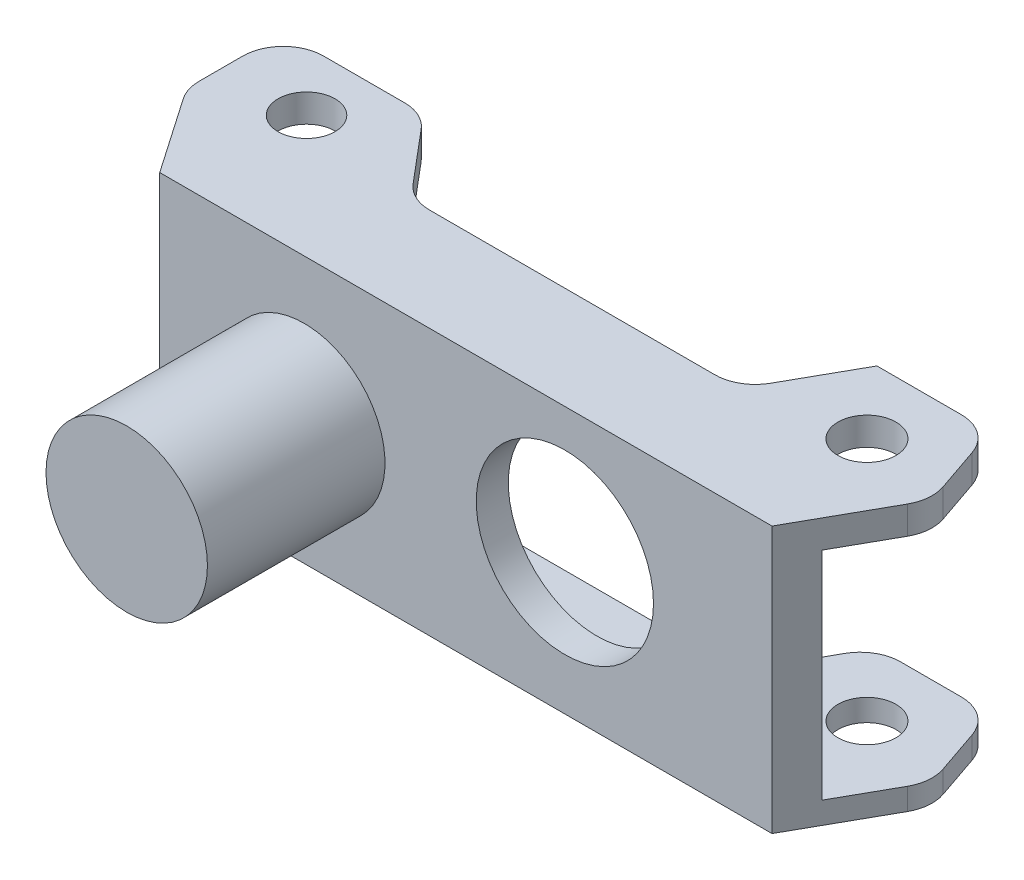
ISO-10303-21;
HEADER;
FILE_DESCRIPTION(('STEP AP214'),'2;1');
FILE_NAME('part.step','',(''),(''),'','','');
FILE_SCHEMA(('AUTOMOTIVE_DESIGN { 1 0 10303 214 1 1 1 1 }'));
ENDSEC;
DATA;
#1=APPLICATION_CONTEXT('core data for automotive mechanical design processes');
#2=APPLICATION_PROTOCOL_DEFINITION('international standard','automotive_design',2000,#1);
#3=PRODUCT_CONTEXT('',#1,'mechanical');
#4=PRODUCT('Part','Part','',(#3));
#5=PRODUCT_RELATED_PRODUCT_CATEGORY('part','',(#4));
#6=PRODUCT_DEFINITION_FORMATION('','',#4);
#7=PRODUCT_DEFINITION_CONTEXT('part definition',#1,'design');
#8=PRODUCT_DEFINITION('design','',#6,#7);
#9=PRODUCT_DEFINITION_SHAPE('','',#8);
#10=(LENGTH_UNIT() NAMED_UNIT(*) SI_UNIT(.MILLI.,.METRE.));
#11=(NAMED_UNIT(*) PLANE_ANGLE_UNIT() SI_UNIT($,.RADIAN.));
#12=(NAMED_UNIT(*) SI_UNIT($,.STERADIAN.) SOLID_ANGLE_UNIT());
#13=UNCERTAINTY_MEASURE_WITH_UNIT(LENGTH_MEASURE(1.E-05),#10,'distance_accuracy_value','');
#14=(GEOMETRIC_REPRESENTATION_CONTEXT(3) GLOBAL_UNCERTAINTY_ASSIGNED_CONTEXT((#13)) GLOBAL_UNIT_ASSIGNED_CONTEXT((#10,
#11,#12)) REPRESENTATION_CONTEXT('',''));
#15=CARTESIAN_POINT('',(0.,0.,0.));
#16=DIRECTION('',(0.,0.,1.));
#17=DIRECTION('',(1.,0.,0.));
#18=AXIS2_PLACEMENT_3D('',#15,#16,#17);
#19=CARTESIAN_POINT('',(-23.2643645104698,-33.,-17.6761686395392));
#20=DIRECTION('',(-1.,0.,0.));
#21=DIRECTION('',(0.,0.,1.));
#22=AXIS2_PLACEMENT_3D('',#19,#20,#21);
#23=PLANE('',#22);
#24=DIRECTION('',(0.,0.,-1.));
#25=VECTOR('',#24,1.);
#26=CARTESIAN_POINT('',(-23.2643645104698,-3.45993507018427,-32.8437082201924));
#27=LINE('',#26,#25);
#28=CARTESIAN_POINT('',(-23.2643645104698,-3.45993507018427,-19.2320013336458));
#29=VERTEX_POINT('',#28);
#30=CARTESIAN_POINT('',(-23.2643645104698,-3.45993507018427,-24.6517278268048));
#31=VERTEX_POINT('',#30);
#32=EDGE_CURVE('E287',#29,#31,#27,.T.);
#33=ORIENTED_EDGE('',*,*,#32,.F.);
#34=DIRECTION('',(0.,1.,0.));
#35=VECTOR('',#34,1.);
#36=CARTESIAN_POINT('',(-23.2643645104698,-33.,-19.2320013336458));
#37=LINE('',#36,#35);
#38=CARTESIAN_POINT('',(-23.2643645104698,0.,-19.2320013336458));
#39=VERTEX_POINT('',#38);
#40=EDGE_CURVE('E512',#29,#39,#37,.T.);
#41=ORIENTED_EDGE('',*,*,#40,.T.);
#42=DIRECTION('',(0.,0.,1.));
#43=VECTOR('',#42,1.);
#44=CARTESIAN_POINT('',(-23.2643645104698,0.,-17.6761686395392));
#45=LINE('',#44,#43);
#46=CARTESIAN_POINT('',(-23.2643645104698,0.,-24.6517278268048));
#47=VERTEX_POINT('',#46);
#48=EDGE_CURVE('E366',#47,#39,#45,.T.);
#49=ORIENTED_EDGE('',*,*,#48,.F.);
#50=DIRECTION('',(0.,1.,0.));
#51=VECTOR('',#50,1.);
#52=CARTESIAN_POINT('',(-23.2643645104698,-33.,-24.6517278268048));
#53=LINE('',#52,#51);
#54=EDGE_CURVE('E510',#47,#31,#53,.F.);
#55=ORIENTED_EDGE('',*,*,#54,.T.);
#56=EDGE_LOOP('',(#33,#41,#49,#55));
#57=FACE_BOUND('',#56,.T.);
#58=ADVANCED_FACE('F36',(#57),#23,.T.);
#59=CARTESIAN_POINT('',(-23.2643645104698,-33.,-29.6517278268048));
#60=DIRECTION('',(0.,0.,-1.));
#61=DIRECTION('',(-1.,0.,0.));
#62=AXIS2_PLACEMENT_3D('',#59,#60,#61);
#63=PLANE('',#62);
#64=DIRECTION('',(-1.,0.,0.));
#65=VECTOR('',#64,1.);
#66=CARTESIAN_POINT('',(-23.2643645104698,0.,-29.6517278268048));
#67=LINE('',#66,#65);
#68=CARTESIAN_POINT('',(-8.20956267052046,0.,-29.6517278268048));
#69=VERTEX_POINT('',#68);
#70=CARTESIAN_POINT('',(-18.2643645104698,0.,-29.6517278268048));
#71=VERTEX_POINT('',#70);
#72=EDGE_CURVE('E363',#69,#71,#67,.T.);
#73=ORIENTED_EDGE('',*,*,#72,.F.);
#74=DIRECTION('',(0.,1.,0.));
#75=VECTOR('',#74,1.);
#76=CARTESIAN_POINT('',(-8.20956267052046,-33.,-29.6517278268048));
#77=LINE('',#76,#75);
#78=CARTESIAN_POINT('',(-8.20956267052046,-3.45993507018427,-29.6517278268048));
#79=VERTEX_POINT('',#78);
#80=EDGE_CURVE('E494',#69,#79,#77,.F.);
#81=ORIENTED_EDGE('',*,*,#80,.T.);
#82=DIRECTION('',(1.,0.,0.));
#83=VECTOR('',#82,1.);
#84=CARTESIAN_POINT('',(-23.2643645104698,-3.45993507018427,-29.6517278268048));
#85=LINE('',#84,#83);
#86=CARTESIAN_POINT('',(-18.2643645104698,-3.45993507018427,-29.6517278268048));
#87=VERTEX_POINT('',#86);
#88=EDGE_CURVE('E308',#87,#79,#85,.T.);
#89=ORIENTED_EDGE('',*,*,#88,.F.);
#90=DIRECTION('',(0.,1.,0.));
#91=VECTOR('',#90,1.);
#92=CARTESIAN_POINT('',(-18.2643645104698,-33.,-29.6517278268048));
#93=LINE('',#92,#91);
#94=EDGE_CURVE('E491',#87,#71,#93,.T.);
#95=ORIENTED_EDGE('',*,*,#94,.T.);
#96=EDGE_LOOP('',(#73,#81,#89,#95));
#97=FACE_BOUND('',#96,.T.);
#98=ADVANCED_FACE('F697',(#97),#63,.T.);
#99=CARTESIAN_POINT('',(-5.88455509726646,-33.,-29.6517278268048));
#100=DIRECTION('',(0.764662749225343,0.,-0.644430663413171));
#101=DIRECTION('',(-0.644430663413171,0.,-0.764662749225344));
#102=AXIS2_PLACEMENT_3D('',#99,#100,#101);
#103=PLANE('',#102);
#104=DIRECTION('',(-0.644430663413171,0.,-0.764662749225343));
#105=VECTOR('',#104,1.);
#106=CARTESIAN_POINT('',(-5.88455509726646,0.,-29.6517278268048));
#107=LINE('',#106,#105);
#108=CARTESIAN_POINT('',(1.01174835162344,0.,-21.4687740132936));
#109=VERTEX_POINT('',#108);
#110=CARTESIAN_POINT('',(-4.38624892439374,0.,-27.8738811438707));
#111=VERTEX_POINT('',#110);
#112=EDGE_CURVE('E360',#109,#111,#107,.T.);
#113=ORIENTED_EDGE('',*,*,#112,.F.);
#114=DIRECTION('',(0.,1.,0.));
#115=VECTOR('',#114,1.);
#116=CARTESIAN_POINT('',(1.01174835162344,-3.45993507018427,-21.4687740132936));
#117=LINE('',#116,#115);
#118=CARTESIAN_POINT('',(1.01174835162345,-3.45993507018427,-21.4687740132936));
#119=VERTEX_POINT('',#118);
#120=EDGE_CURVE('E489',#109,#119,#117,.F.);
#121=ORIENTED_EDGE('',*,*,#120,.T.);
#122=DIRECTION('',(0.644430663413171,0.,0.764662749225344));
#123=VECTOR('',#122,1.);
#124=CARTESIAN_POINT('',(-5.88455509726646,-3.45993507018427,-29.6517278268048));
#125=LINE('',#124,#123);
#126=CARTESIAN_POINT('',(-4.38624892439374,-3.45993507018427,-27.8738811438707));
#127=VERTEX_POINT('',#126);
#128=EDGE_CURVE('E305',#127,#119,#125,.T.);
#129=ORIENTED_EDGE('',*,*,#128,.F.);
#130=DIRECTION('',(0.,1.,0.));
#131=VECTOR('',#130,1.);
#132=CARTESIAN_POINT('',(-4.38624892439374,-33.,-27.8738811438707));
#133=LINE('',#132,#131);
#134=EDGE_CURVE('E486',#127,#111,#133,.T.);
#135=ORIENTED_EDGE('',*,*,#134,.T.);
#136=EDGE_LOOP('',(#113,#121,#129,#135));
#137=FACE_BOUND('',#136,.T.);
#138=ADVANCED_FACE('F534',(#137),#103,.T.);
#139=CARTESIAN_POINT('',(2.51005452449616,-33.,-19.6909273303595));
#140=DIRECTION('',(0.,0.,-1.));
#141=DIRECTION('',(-1.,0.,0.));
#142=AXIS2_PLACEMENT_3D('',#139,#140,#141);
#143=PLANE('',#142);
#144=DIRECTION('',(-1.,0.,0.));
#145=VECTOR('',#144,1.);
#146=CARTESIAN_POINT('',(2.51005452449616,0.,-19.6909273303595));
#147=LINE('',#146,#145);
#148=CARTESIAN_POINT('',(40.1852218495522,0.,-19.6909273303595));
#149=VERTEX_POINT('',#148);
#150=CARTESIAN_POINT('',(4.83506209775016,0.,-19.6909273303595));
#151=VERTEX_POINT('',#150);
#152=EDGE_CURVE('E357',#149,#151,#147,.T.);
#153=ORIENTED_EDGE('',*,*,#152,.F.);
#154=DIRECTION('',(0.,1.,0.));
#155=VECTOR('',#154,1.);
#156=CARTESIAN_POINT('',(40.1852218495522,-3.45993507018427,-19.6909273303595));
#157=LINE('',#156,#155);
#158=CARTESIAN_POINT('',(40.1852218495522,-3.45993507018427,-19.6909273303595));
#159=VERTEX_POINT('',#158);
#160=EDGE_CURVE('E479',#149,#159,#157,.F.);
#161=ORIENTED_EDGE('',*,*,#160,.T.);
#162=DIRECTION('',(1.,0.,0.));
#163=VECTOR('',#162,1.);
#164=CARTESIAN_POINT('',(2.51005452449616,-3.45993507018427,-19.6909273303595));
#165=LINE('',#164,#163);
#166=CARTESIAN_POINT('',(4.83506209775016,-3.45993507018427,-19.6909273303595));
#167=VERTEX_POINT('',#166);
#168=EDGE_CURVE('E303',#167,#159,#165,.T.);
#169=ORIENTED_EDGE('',*,*,#168,.F.);
#170=DIRECTION('',(0.,1.,0.));
#171=VECTOR('',#170,1.);
#172=CARTESIAN_POINT('',(4.83506209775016,0.,-19.6909273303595));
#173=LINE('',#172,#171);
#174=EDGE_CURVE('E476',#167,#151,#173,.T.);
#175=ORIENTED_EDGE('',*,*,#174,.T.);
#176=EDGE_LOOP('',(#153,#161,#169,#175));
#177=FACE_BOUND('',#176,.T.);
#178=ADVANCED_FACE('F542',(#177),#143,.T.);
#179=CARTESIAN_POINT('',(43.114449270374,-33.,-19.6909273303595));
#180=DIRECTION('',(-0.872303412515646,0.,-0.488964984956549));
#181=DIRECTION('',(-0.488964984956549,0.,0.872303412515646));
#182=AXIS2_PLACEMENT_3D('',#179,#180,#181);
#183=PLANE('',#182);
#184=DIRECTION('',(0.488964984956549,0.,-0.872303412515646));
#185=VECTOR('',#184,1.);
#186=CARTESIAN_POINT('',(43.114449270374,-3.45993507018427,-19.6909273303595));
#187=LINE('',#186,#185);
#188=CARTESIAN_POINT('',(44.5467389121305,-3.45993507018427,-22.2461024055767));
#189=VERTEX_POINT('',#188);
#190=CARTESIAN_POINT('',(49.2733082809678,-3.45993507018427,-30.6782043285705));
#191=VERTEX_POINT('',#190);
#192=EDGE_CURVE('E301',#189,#191,#187,.T.);
#193=ORIENTED_EDGE('',*,*,#192,.F.);
#194=DIRECTION('',(0.,1.,0.));
#195=VECTOR('',#194,1.);
#196=CARTESIAN_POINT('',(44.5467389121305,0.,-22.2461024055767));
#197=LINE('',#196,#195);
#198=CARTESIAN_POINT('',(44.5467389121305,0.,-22.2461024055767));
#199=VERTEX_POINT('',#198);
#200=EDGE_CURVE('E473',#189,#199,#197,.T.);
#201=ORIENTED_EDGE('',*,*,#200,.T.);
#202=DIRECTION('',(-0.488964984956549,0.,0.872303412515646));
#203=VECTOR('',#202,1.);
#204=CARTESIAN_POINT('',(43.114449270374,0.,-19.6909273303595));
#205=LINE('',#204,#203);
#206=CARTESIAN_POINT('',(49.2733082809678,0.,-30.6782043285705));
#207=VERTEX_POINT('',#206);
#208=EDGE_CURVE('E354',#207,#199,#205,.T.);
#209=ORIENTED_EDGE('',*,*,#208,.F.);
#210=DIRECTION('',(0.,1.,0.));
#211=VECTOR('',#210,1.);
#212=CARTESIAN_POINT('',(49.2733082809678,-33.,-30.6782043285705));
#213=LINE('',#212,#211);
#214=EDGE_CURVE('E374',#191,#207,#213,.T.);
#215=ORIENTED_EDGE('',*,*,#214,.F.);
#216=EDGE_LOOP('',(#193,#201,#209,#215));
#217=FACE_BOUND('',#216,.T.);
#218=ADVANCED_FACE('F549',(#217),#183,.T.);
#219=CARTESIAN_POINT('',(49.2733082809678,-33.,-30.6782043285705));
#220=DIRECTION('',(0.,0.,-1.));
#221=DIRECTION('',(-1.,0.,0.));
#222=AXIS2_PLACEMENT_3D('',#219,#220,#221);
#223=PLANE('',#222);
#224=DIRECTION('',(-1.,0.,0.));
#225=VECTOR('',#224,1.);
#226=CARTESIAN_POINT('',(49.2733082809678,0.,-30.6782043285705));
#227=LINE('',#226,#225);
#228=CARTESIAN_POINT('',(59.7293711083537,0.,-30.6782043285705));
#229=VERTEX_POINT('',#228);
#230=EDGE_CURVE('E352',#229,#207,#227,.T.);
#231=ORIENTED_EDGE('',*,*,#230,.F.);
#232=DIRECTION('',(0.,1.,0.));
#233=VECTOR('',#232,1.);
#234=CARTESIAN_POINT('',(59.7293711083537,-33.,-30.6782043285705));
#235=LINE('',#234,#233);
#236=CARTESIAN_POINT('',(59.7293711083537,-3.45993507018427,-30.6782043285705));
#237=VERTEX_POINT('',#236);
#238=EDGE_CURVE('E52',#229,#237,#235,.F.);
#239=ORIENTED_EDGE('',*,*,#238,.T.);
#240=DIRECTION('',(1.,0.,0.));
#241=VECTOR('',#240,1.);
#242=CARTESIAN_POINT('',(49.2733082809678,-3.45993507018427,-30.6782043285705));
#243=LINE('',#242,#241);
#244=EDGE_CURVE('E296',#191,#237,#243,.T.);
#245=ORIENTED_EDGE('',*,*,#244,.F.);
#246=ORIENTED_EDGE('',*,*,#214,.T.);
#247=EDGE_LOOP('',(#231,#239,#245,#246));
#248=FACE_BOUND('',#247,.T.);
#249=ADVANCED_FACE('F551',(#248),#223,.T.);
#250=CARTESIAN_POINT('',(63.3018204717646,-33.,-30.6782043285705));
#251=DIRECTION('',(0.946033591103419,0.,-0.324068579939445));
#252=DIRECTION('',(-0.324068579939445,0.,-0.946033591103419));
#253=AXIS2_PLACEMENT_3D('',#250,#251,#252);
#254=PLANE('',#253);
#255=DIRECTION('',(-0.324068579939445,0.,-0.946033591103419));
#256=VECTOR('',#255,1.);
#257=CARTESIAN_POINT('',(63.3018204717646,0.,-30.6782043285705));
#258=LINE('',#257,#256);
#259=CARTESIAN_POINT('',(66.341063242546,0.,-21.8059287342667));
#260=VERTEX_POINT('',#259);
#261=CARTESIAN_POINT('',(64.4595390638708,0.,-27.2985472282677));
#262=VERTEX_POINT('',#261);
#263=EDGE_CURVE('E349',#260,#262,#258,.T.);
#264=ORIENTED_EDGE('',*,*,#263,.F.);
#265=DIRECTION('',(0.,1.,0.));
#266=VECTOR('',#265,1.);
#267=CARTESIAN_POINT('',(66.341063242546,-33.,-21.8059287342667));
#268=LINE('',#267,#266);
#269=CARTESIAN_POINT('',(66.341063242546,-3.45993507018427,-21.8059287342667));
#270=VERTEX_POINT('',#269);
#271=EDGE_CURVE('E445',#260,#270,#268,.F.);
#272=ORIENTED_EDGE('',*,*,#271,.T.);
#273=DIRECTION('',(0.324068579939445,0.,0.946033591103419));
#274=VECTOR('',#273,1.);
#275=CARTESIAN_POINT('',(63.3018204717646,-3.45993507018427,-30.6782043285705));
#276=LINE('',#275,#274);
#277=CARTESIAN_POINT('',(64.4595390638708,-3.45993507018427,-27.2985472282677));
#278=VERTEX_POINT('',#277);
#279=EDGE_CURVE('E293',#278,#270,#276,.T.);
#280=ORIENTED_EDGE('',*,*,#279,.F.);
#281=DIRECTION('',(0.,1.,0.));
#282=VECTOR('',#281,1.);
#283=CARTESIAN_POINT('',(64.4595390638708,-33.,-27.2985472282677));
#284=LINE('',#283,#282);
#285=EDGE_CURVE('E442',#278,#262,#284,.T.);
#286=ORIENTED_EDGE('',*,*,#285,.T.);
#287=EDGE_LOOP('',(#264,#272,#280,#286));
#288=FACE_BOUND('',#287,.T.);
#289=ADVANCED_FACE('F559',(#288),#254,.T.);
#290=CARTESIAN_POINT('',(2.,-17.2270584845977,15.));
#291=DIRECTION('',(0.,0.,-1.));
#292=DIRECTION('',(-1.,0.,0.));
#293=AXIS2_PLACEMENT_3D('',#290,#291,#292);
#294=CYLINDRICAL_SURFACE('',#293,10.);
#295=CARTESIAN_POINT('',(2.,-17.2270584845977,15.));
#296=DIRECTION('',(0.,0.,1.));
#297=DIRECTION('',(1.,0.,0.));
#298=AXIS2_PLACEMENT_3D('',#295,#296,#297);
#299=CIRCLE('',#298,10.);
#300=CARTESIAN_POINT('',(12.,-17.2270584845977,15.));
#301=VERTEX_POINT('',#300);
#302=EDGE_CURVE('E380',#301,#301,#299,.T.);
#303=ORIENTED_EDGE('',*,*,#302,.F.);
#304=EDGE_LOOP('',(#303));
#305=FACE_BOUND('',#304,.T.);
#306=CARTESIAN_POINT('',(2.,-17.2270584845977,-7.));
#307=DIRECTION('',(0.,0.,-1.));
#308=DIRECTION('',(-1.,0.,0.));
#309=AXIS2_PLACEMENT_3D('',#306,#307,#308);
#310=CIRCLE('',#309,10.);
#311=CARTESIAN_POINT('',(-8.,-17.2270584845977,-7.));
#312=VERTEX_POINT('',#311);
#313=EDGE_CURVE('E373',#312,#312,#310,.T.);
#314=ORIENTED_EDGE('',*,*,#313,.F.);
#315=EDGE_LOOP('',(#314));
#316=FACE_BOUND('',#315,.T.);
#317=ADVANCED_FACE('F836',(#305,#316),#294,.T.);
#318=CARTESIAN_POINT('',(2.,-17.2270584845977,15.));
#319=DIRECTION('',(0.,0.,1.));
#320=DIRECTION('',(1.,0.,0.));
#321=AXIS2_PLACEMENT_3D('',#318,#319,#320);
#322=PLANE('',#321);
#323=ORIENTED_EDGE('',*,*,#302,.T.);
#324=EDGE_LOOP('',(#323));
#325=FACE_BOUND('',#324,.T.);
#326=ADVANCED_FACE('F715',(#325),#322,.T.);
#327=CARTESIAN_POINT('',(59.9517366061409,-33.,-7.));
#328=DIRECTION('',(0.,0.,1.));
#329=DIRECTION('',(1.,0.,0.));
#330=AXIS2_PLACEMENT_3D('',#327,#328,#329);
#331=PLANE('',#330);
#332=CARTESIAN_POINT('',(34.2854004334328,-15.6525262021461,-7.));
#333=DIRECTION('',(0.,0.,1.));
#334=DIRECTION('',(1.,0.,0.));
#335=AXIS2_PLACEMENT_3D('',#332,#333,#334);
#336=CIRCLE('',#335,10.9809764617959);
#337=CARTESIAN_POINT('',(45.2663768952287,-15.6525262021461,-7.));
#338=VERTEX_POINT('',#337);
#339=EDGE_CURVE('E679',#338,#338,#336,.T.);
#340=ORIENTED_EDGE('',*,*,#339,.F.);
#341=EDGE_LOOP('',(#340));
#342=FACE_BOUND('',#341,.T.);
#343=DIRECTION('',(1.,0.,0.));
#344=VECTOR('',#343,1.);
#345=CARTESIAN_POINT('',(59.9517366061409,0.,-7.));
#346=LINE('',#345,#344);
#347=CARTESIAN_POINT('',(-15.9079495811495,0.,-7.));
#348=VERTEX_POINT('',#347);
#349=CARTESIAN_POINT('',(59.9517366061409,0.,-7.));
#350=VERTEX_POINT('',#349);
#351=EDGE_CURVE('E312',#348,#350,#346,.T.);
#352=ORIENTED_EDGE('',*,*,#351,.F.);
#353=DIRECTION('',(0.,1.,0.));
#354=VECTOR('',#353,1.);
#355=CARTESIAN_POINT('',(-15.9079495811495,-33.,-7.));
#356=LINE('',#355,#354);
#357=CARTESIAN_POINT('',(-15.9079495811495,-33.,-7.));
#358=VERTEX_POINT('',#357);
#359=EDGE_CURVE('E370',#358,#348,#356,.T.);
#360=ORIENTED_EDGE('',*,*,#359,.F.);
#361=DIRECTION('',(1.,0.,0.));
#362=VECTOR('',#361,1.);
#363=CARTESIAN_POINT('',(59.9517366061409,-33.,-7.));
#364=LINE('',#363,#362);
#365=CARTESIAN_POINT('',(59.9517366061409,-33.,-7.));
#366=VERTEX_POINT('',#365);
#367=EDGE_CURVE('E313',#358,#366,#364,.T.);
#368=ORIENTED_EDGE('',*,*,#367,.T.);
#369=DIRECTION('',(0.,1.,0.));
#370=VECTOR('',#369,1.);
#371=CARTESIAN_POINT('',(59.9517366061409,-33.,-7.));
#372=LINE('',#371,#370);
#373=EDGE_CURVE('E343',#366,#350,#372,.T.);
#374=ORIENTED_EDGE('',*,*,#373,.T.);
#375=EDGE_LOOP('',(#352,#360,#368,#374));
#376=FACE_BOUND('',#375,.T.);
#377=ORIENTED_EDGE('',*,*,#313,.T.);
#378=EDGE_LOOP('',(#377));
#379=FACE_BOUND('',#378,.T.);
#380=ADVANCED_FACE('F650',(#342,#376,#379),#331,.T.);
#381=CARTESIAN_POINT('',(-15.9079495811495,-33.,-7.));
#382=DIRECTION('',(-0.823445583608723,0.,0.567395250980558));
#383=DIRECTION('',(0.567395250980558,0.,0.823445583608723));
#384=AXIS2_PLACEMENT_3D('',#381,#382,#383);
#385=PLANE('',#384);
#386=DIRECTION('',(0.567395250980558,0.,0.823445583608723));
#387=VECTOR('',#386,1.);
#388=CARTESIAN_POINT('',(-15.9079495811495,-30.2846895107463,-7.));
#389=LINE('',#388,#387);
#390=CARTESIAN_POINT('',(-22.3815924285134,-30.2846895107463,-16.395025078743));
#391=VERTEX_POINT('',#390);
#392=CARTESIAN_POINT('',(-18.6453012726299,-30.2846895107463,-10.9726454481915));
#393=VERTEX_POINT('',#392);
#394=EDGE_CURVE('E265',#391,#393,#389,.T.);
#395=ORIENTED_EDGE('',*,*,#394,.F.);
#396=DIRECTION('',(0.,1.,0.));
#397=VECTOR('',#396,1.);
#398=CARTESIAN_POINT('',(-22.3815924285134,-33.,-16.395025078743));
#399=LINE('',#398,#397);
#400=CARTESIAN_POINT('',(-22.3815924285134,-33.,-16.395025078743));
#401=VERTEX_POINT('',#400);
#402=EDGE_CURVE('E508',#391,#401,#399,.F.);
#403=ORIENTED_EDGE('',*,*,#402,.T.);
#404=DIRECTION('',(0.567395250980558,0.,0.823445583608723));
#405=VECTOR('',#404,1.);
#406=CARTESIAN_POINT('',(-15.9079495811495,-33.,-7.));
#407=LINE('',#406,#405);
#408=EDGE_CURVE('E341',#401,#358,#407,.T.);
#409=ORIENTED_EDGE('',*,*,#408,.T.);
#410=ORIENTED_EDGE('',*,*,#359,.T.);
#411=DIRECTION('',(0.567395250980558,0.,0.823445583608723));
#412=VECTOR('',#411,1.);
#413=CARTESIAN_POINT('',(-15.9079495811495,0.,-7.));
#414=LINE('',#413,#412);
#415=CARTESIAN_POINT('',(-22.3815924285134,0.,-16.395025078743));
#416=VERTEX_POINT('',#415);
#417=EDGE_CURVE('E317',#416,#348,#414,.T.);
#418=ORIENTED_EDGE('',*,*,#417,.F.);
#419=DIRECTION('',(0.,1.,0.));
#420=VECTOR('',#419,1.);
#421=CARTESIAN_POINT('',(-22.3815924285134,-33.,-16.395025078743));
#422=LINE('',#421,#420);
#423=CARTESIAN_POINT('',(-22.3815924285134,-3.45993507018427,-16.395025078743));
#424=VERTEX_POINT('',#423);
#425=EDGE_CURVE('E506',#416,#424,#422,.F.);
#426=ORIENTED_EDGE('',*,*,#425,.T.);
#427=DIRECTION('',(-0.567395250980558,0.,-0.823445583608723));
#428=VECTOR('',#427,1.);
#429=CARTESIAN_POINT('',(-15.9079495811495,-3.45993507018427,-7.));
#430=LINE('',#429,#428);
#431=CARTESIAN_POINT('',(-18.6453012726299,-3.45993507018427,-10.9726454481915));
#432=VERTEX_POINT('',#431);
#433=EDGE_CURVE('E292',#432,#424,#430,.T.);
#434=ORIENTED_EDGE('',*,*,#433,.F.);
#435=DIRECTION('',(0.,1.,0.));
#436=VECTOR('',#435,1.);
#437=CARTESIAN_POINT('',(-18.6453012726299,-33.,-10.9726454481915));
#438=LINE('',#437,#436);
#439=EDGE_CURVE('E276',#393,#432,#438,.T.);
#440=ORIENTED_EDGE('',*,*,#439,.F.);
#441=EDGE_LOOP('',(#395,#403,#409,#410,#418,#426,#434,#440));
#442=FACE_BOUND('',#441,.T.);
#443=ADVANCED_FACE('F290',(#442),#385,.T.);
#444=DIRECTION('',(0.,0.,1.));
#445=VECTOR('',#444,1.);
#446=CARTESIAN_POINT('',(-23.2643645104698,-33.,-17.6761686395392));
#447=LINE('',#446,#445);
#448=CARTESIAN_POINT('',(-23.2643645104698,-33.,-24.6517278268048));
#449=VERTEX_POINT('',#448);
#450=CARTESIAN_POINT('',(-23.2643645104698,-33.,-19.2320013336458));
#451=VERTEX_POINT('',#450);
#452=EDGE_CURVE('E338',#449,#451,#447,.T.);
#453=ORIENTED_EDGE('',*,*,#452,.T.);
#454=DIRECTION('',(0.,1.,0.));
#455=VECTOR('',#454,1.);
#456=CARTESIAN_POINT('',(-23.2643645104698,-33.,-19.2320013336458));
#457=LINE('',#456,#455);
#458=CARTESIAN_POINT('',(-23.2643645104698,-30.2846895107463,-19.2320013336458));
#459=VERTEX_POINT('',#458);
#460=EDGE_CURVE('E503',#451,#459,#457,.T.);
#461=ORIENTED_EDGE('',*,*,#460,.T.);
#462=DIRECTION('',(0.,0.,1.));
#463=VECTOR('',#462,1.);
#464=CARTESIAN_POINT('',(-23.2643645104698,-30.2846895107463,-32.8437082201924));
#465=LINE('',#464,#463);
#466=CARTESIAN_POINT('',(-23.2643645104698,-30.2846895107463,-24.6517278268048));
#467=VERTEX_POINT('',#466);
#468=EDGE_CURVE('E661',#467,#459,#465,.T.);
#469=ORIENTED_EDGE('',*,*,#468,.F.);
#470=DIRECTION('',(0.,1.,0.));
#471=VECTOR('',#470,1.);
#472=CARTESIAN_POINT('',(-23.2643645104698,-33.,-24.6517278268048));
#473=LINE('',#472,#471);
#474=EDGE_CURVE('E501',#467,#449,#473,.F.);
#475=ORIENTED_EDGE('',*,*,#474,.T.);
#476=EDGE_LOOP('',(#453,#461,#469,#475));
#477=FACE_BOUND('',#476,.T.);
#478=ADVANCED_FACE('F660',(#477),#23,.T.);
#479=DIRECTION('',(-1.,0.,0.));
#480=VECTOR('',#479,1.);
#481=CARTESIAN_POINT('',(-23.2643645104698,-30.2846895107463,-29.6517278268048));
#482=LINE('',#481,#480);
#483=CARTESIAN_POINT('',(-8.20956267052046,-30.2846895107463,-29.6517278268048));
#484=VERTEX_POINT('',#483);
#485=CARTESIAN_POINT('',(-18.2643645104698,-30.2846895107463,-29.6517278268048));
#486=VERTEX_POINT('',#485);
#487=EDGE_CURVE('E277',#484,#486,#482,.T.);
#488=ORIENTED_EDGE('',*,*,#487,.F.);
#489=DIRECTION('',(0.,1.,0.));
#490=VECTOR('',#489,1.);
#491=CARTESIAN_POINT('',(-8.20956267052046,-33.,-29.6517278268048));
#492=LINE('',#491,#490);
#493=CARTESIAN_POINT('',(-8.20956267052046,-33.,-29.6517278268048));
#494=VERTEX_POINT('',#493);
#495=EDGE_CURVE('E499',#484,#494,#492,.F.);
#496=ORIENTED_EDGE('',*,*,#495,.T.);
#497=DIRECTION('',(-1.,0.,0.));
#498=VECTOR('',#497,1.);
#499=CARTESIAN_POINT('',(-23.2643645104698,-33.,-29.6517278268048));
#500=LINE('',#499,#498);
#501=CARTESIAN_POINT('',(-18.2643645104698,-33.,-29.6517278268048));
#502=VERTEX_POINT('',#501);
#503=EDGE_CURVE('E335',#494,#502,#500,.T.);
#504=ORIENTED_EDGE('',*,*,#503,.T.);
#505=DIRECTION('',(0.,1.,0.));
#506=VECTOR('',#505,1.);
#507=CARTESIAN_POINT('',(-18.2643645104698,-33.,-29.6517278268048));
#508=LINE('',#507,#506);
#509=EDGE_CURVE('E496',#502,#486,#508,.T.);
#510=ORIENTED_EDGE('',*,*,#509,.T.);
#511=EDGE_LOOP('',(#488,#496,#504,#510));
#512=FACE_BOUND('',#511,.T.);
#513=ADVANCED_FACE('F592',(#512),#63,.T.);
#514=DIRECTION('',(-0.644430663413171,0.,-0.764662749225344));
#515=VECTOR('',#514,1.);
#516=CARTESIAN_POINT('',(-5.88455509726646,-30.2846895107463,-29.6517278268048));
#517=LINE('',#516,#515);
#518=CARTESIAN_POINT('',(1.01174835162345,-30.2846895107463,-21.4687740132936));
#519=VERTEX_POINT('',#518);
#520=CARTESIAN_POINT('',(-4.38624892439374,-30.2846895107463,-27.8738811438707));
#521=VERTEX_POINT('',#520);
#522=EDGE_CURVE('E585',#519,#521,#517,.T.);
#523=ORIENTED_EDGE('',*,*,#522,.F.);
#524=DIRECTION('',(0.,1.,0.));
#525=VECTOR('',#524,1.);
#526=CARTESIAN_POINT('',(1.01174835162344,-33.,-21.4687740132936));
#527=LINE('',#526,#525);
#528=CARTESIAN_POINT('',(1.01174835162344,-33.,-21.4687740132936));
#529=VERTEX_POINT('',#528);
#530=EDGE_CURVE('E484',#519,#529,#527,.F.);
#531=ORIENTED_EDGE('',*,*,#530,.T.);
#532=DIRECTION('',(-0.644430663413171,0.,-0.764662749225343));
#533=VECTOR('',#532,1.);
#534=CARTESIAN_POINT('',(-5.88455509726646,-33.,-29.6517278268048));
#535=LINE('',#534,#533);
#536=CARTESIAN_POINT('',(-4.38624892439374,-33.,-27.8738811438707));
#537=VERTEX_POINT('',#536);
#538=EDGE_CURVE('E332',#529,#537,#535,.T.);
#539=ORIENTED_EDGE('',*,*,#538,.T.);
#540=DIRECTION('',(0.,1.,0.));
#541=VECTOR('',#540,1.);
#542=CARTESIAN_POINT('',(-4.38624892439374,-33.,-27.8738811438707));
#543=LINE('',#542,#541);
#544=EDGE_CURVE('E481',#537,#521,#543,.T.);
#545=ORIENTED_EDGE('',*,*,#544,.T.);
#546=EDGE_LOOP('',(#523,#531,#539,#545));
#547=FACE_BOUND('',#546,.T.);
#548=ADVANCED_FACE('F606',(#547),#103,.T.);
#549=DIRECTION('',(-1.,0.,0.));
#550=VECTOR('',#549,1.);
#551=CARTESIAN_POINT('',(2.51005452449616,-30.2846895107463,-19.6909273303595));
#552=LINE('',#551,#550);
#553=CARTESIAN_POINT('',(40.1852218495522,-30.2846895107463,-19.6909273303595));
#554=VERTEX_POINT('',#553);
#555=CARTESIAN_POINT('',(4.83506209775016,-30.2846895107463,-19.6909273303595));
#556=VERTEX_POINT('',#555);
#557=EDGE_CURVE('E582',#554,#556,#552,.T.);
#558=ORIENTED_EDGE('',*,*,#557,.F.);
#559=DIRECTION('',(0.,1.,0.));
#560=VECTOR('',#559,1.);
#561=CARTESIAN_POINT('',(40.1852218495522,-33.,-19.6909273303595));
#562=LINE('',#561,#560);
#563=CARTESIAN_POINT('',(40.1852218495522,-33.,-19.6909273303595));
#564=VERTEX_POINT('',#563);
#565=EDGE_CURVE('E471',#554,#564,#562,.F.);
#566=ORIENTED_EDGE('',*,*,#565,.T.);
#567=DIRECTION('',(-1.,0.,0.));
#568=VECTOR('',#567,1.);
#569=CARTESIAN_POINT('',(2.51005452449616,-33.,-19.6909273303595));
#570=LINE('',#569,#568);
#571=CARTESIAN_POINT('',(4.83506209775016,-33.,-19.6909273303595));
#572=VERTEX_POINT('',#571);
#573=EDGE_CURVE('E329',#564,#572,#570,.T.);
#574=ORIENTED_EDGE('',*,*,#573,.T.);
#575=DIRECTION('',(0.,1.,0.));
#576=VECTOR('',#575,1.);
#577=CARTESIAN_POINT('',(4.83506209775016,-30.2846895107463,-19.6909273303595));
#578=LINE('',#577,#576);
#579=EDGE_CURVE('E468',#572,#556,#578,.T.);
#580=ORIENTED_EDGE('',*,*,#579,.T.);
#581=EDGE_LOOP('',(#558,#566,#574,#580));
#582=FACE_BOUND('',#581,.T.);
#583=ADVANCED_FACE('F615',(#582),#143,.T.);
#584=DIRECTION('',(-0.488964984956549,0.,0.872303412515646));
#585=VECTOR('',#584,1.);
#586=CARTESIAN_POINT('',(43.114449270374,-30.2846895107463,-19.6909273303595));
#587=LINE('',#586,#585);
#588=CARTESIAN_POINT('',(47.8410186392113,-30.2846895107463,-28.1230292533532));
#589=VERTEX_POINT('',#588);
#590=CARTESIAN_POINT('',(44.5467389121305,-30.2846895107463,-22.2461024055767));
#591=VERTEX_POINT('',#590);
#592=EDGE_CURVE('E579',#589,#591,#587,.T.);
#593=ORIENTED_EDGE('',*,*,#592,.F.);
#594=DIRECTION('',(0.,1.,0.));
#595=VECTOR('',#594,1.);
#596=CARTESIAN_POINT('',(47.8410186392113,-33.,-28.1230292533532));
#597=LINE('',#596,#595);
#598=CARTESIAN_POINT('',(47.8410186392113,-33.,-28.1230292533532));
#599=VERTEX_POINT('',#598);
#600=EDGE_CURVE('E466',#589,#599,#597,.F.);
#601=ORIENTED_EDGE('',*,*,#600,.T.);
#602=DIRECTION('',(-0.488964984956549,0.,0.872303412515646));
#603=VECTOR('',#602,1.);
#604=CARTESIAN_POINT('',(43.114449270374,-33.,-19.6909273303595));
#605=LINE('',#604,#603);
#606=CARTESIAN_POINT('',(44.5467389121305,-33.,-22.2461024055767));
#607=VERTEX_POINT('',#606);
#608=EDGE_CURVE('E326',#599,#607,#605,.T.);
#609=ORIENTED_EDGE('',*,*,#608,.T.);
#610=DIRECTION('',(0.,1.,0.));
#611=VECTOR('',#610,1.);
#612=CARTESIAN_POINT('',(44.5467389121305,-30.2846895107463,-22.2461024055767));
#613=LINE('',#612,#611);
#614=EDGE_CURVE('E463',#607,#591,#613,.T.);
#615=ORIENTED_EDGE('',*,*,#614,.T.);
#616=EDGE_LOOP('',(#593,#601,#609,#615));
#617=FACE_BOUND('',#616,.T.);
#618=ADVANCED_FACE('F624',(#617),#183,.T.);
#619=DIRECTION('',(-1.,0.,0.));
#620=VECTOR('',#619,1.);
#621=CARTESIAN_POINT('',(49.2733082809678,-30.2846895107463,-30.6782043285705));
#622=LINE('',#621,#620);
#623=CARTESIAN_POINT('',(59.7293711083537,-30.2846895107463,-30.6782043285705));
#624=VERTEX_POINT('',#623);
#625=CARTESIAN_POINT('',(52.2025357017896,-30.2846895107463,-30.6782043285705));
#626=VERTEX_POINT('',#625);
#627=EDGE_CURVE('E572',#624,#626,#622,.T.);
#628=ORIENTED_EDGE('',*,*,#627,.F.);
#629=DIRECTION('',(0.,1.,0.));
#630=VECTOR('',#629,1.);
#631=CARTESIAN_POINT('',(59.7293711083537,-33.,-30.6782043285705));
#632=LINE('',#631,#630);
#633=CARTESIAN_POINT('',(59.7293711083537,-33.,-30.6782043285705));
#634=VERTEX_POINT('',#633);
#635=EDGE_CURVE('E461',#624,#634,#632,.F.);
#636=ORIENTED_EDGE('',*,*,#635,.T.);
#637=DIRECTION('',(-1.,0.,0.));
#638=VECTOR('',#637,1.);
#639=CARTESIAN_POINT('',(49.2733082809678,-33.,-30.6782043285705));
#640=LINE('',#639,#638);
#641=CARTESIAN_POINT('',(52.2025357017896,-33.,-30.6782043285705));
#642=VERTEX_POINT('',#641);
#643=EDGE_CURVE('E323',#634,#642,#640,.T.);
#644=ORIENTED_EDGE('',*,*,#643,.T.);
#645=DIRECTION('',(0.,1.,0.));
#646=VECTOR('',#645,1.);
#647=CARTESIAN_POINT('',(52.2025357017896,-33.,-30.6782043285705));
#648=LINE('',#647,#646);
#649=EDGE_CURVE('E458',#642,#626,#648,.T.);
#650=ORIENTED_EDGE('',*,*,#649,.T.);
#651=EDGE_LOOP('',(#628,#636,#644,#650));
#652=FACE_BOUND('',#651,.T.);
#653=ADVANCED_FACE('F633',(#652),#223,.T.);
#654=DIRECTION('',(-0.324068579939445,0.,-0.946033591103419));
#655=VECTOR('',#654,1.);
#656=CARTESIAN_POINT('',(63.3018204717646,-30.2846895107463,-30.6782043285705));
#657=LINE('',#656,#655);
#658=CARTESIAN_POINT('',(66.341063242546,-30.2846895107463,-21.8059287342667));
#659=VERTEX_POINT('',#658);
#660=CARTESIAN_POINT('',(64.4595390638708,-30.2846895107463,-27.2985472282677));
#661=VERTEX_POINT('',#660);
#662=EDGE_CURVE('E569',#659,#661,#657,.T.);
#663=ORIENTED_EDGE('',*,*,#662,.F.);
#664=DIRECTION('',(0.,1.,0.));
#665=VECTOR('',#664,1.);
#666=CARTESIAN_POINT('',(66.341063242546,-33.,-21.8059287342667));
#667=LINE('',#666,#665);
#668=CARTESIAN_POINT('',(66.341063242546,-33.,-21.8059287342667));
#669=VERTEX_POINT('',#668);
#670=EDGE_CURVE('E418',#659,#669,#667,.F.);
#671=ORIENTED_EDGE('',*,*,#670,.T.);
#672=DIRECTION('',(-0.324068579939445,0.,-0.946033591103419));
#673=VECTOR('',#672,1.);
#674=CARTESIAN_POINT('',(63.3018204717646,-33.,-30.6782043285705));
#675=LINE('',#674,#673);
#676=CARTESIAN_POINT('',(64.4595390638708,-33.,-27.2985472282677));
#677=VERTEX_POINT('',#676);
#678=EDGE_CURVE('E320',#669,#677,#675,.T.);
#679=ORIENTED_EDGE('',*,*,#678,.T.);
#680=DIRECTION('',(0.,1.,0.));
#681=VECTOR('',#680,1.);
#682=CARTESIAN_POINT('',(64.4595390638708,-33.,-27.2985472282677));
#683=LINE('',#682,#681);
#684=EDGE_CURVE('E415',#677,#661,#683,.T.);
#685=ORIENTED_EDGE('',*,*,#684,.T.);
#686=EDGE_LOOP('',(#663,#671,#679,#685));
#687=FACE_BOUND('',#686,.T.);
#688=ADVANCED_FACE('F641',(#687),#254,.T.);
#689=CARTESIAN_POINT('',(67.0655676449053,-33.,-19.6909273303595));
#690=DIRECTION('',(0.872303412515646,0.,0.488964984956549));
#691=DIRECTION('',(0.488964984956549,0.,-0.872303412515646));
#692=AXIS2_PLACEMENT_3D('',#689,#690,#691);
#693=PLANE('',#692);
#694=DIRECTION('',(0.488964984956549,0.,-0.872303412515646));
#695=VECTOR('',#694,1.);
#696=CARTESIAN_POINT('',(67.0655676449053,-33.,-19.6909273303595));
#697=LINE('',#696,#695);
#698=CARTESIAN_POINT('',(65.9724123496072,-33.,-17.7407609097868));
#699=VERTEX_POINT('',#698);
#700=EDGE_CURVE('E316',#366,#699,#697,.T.);
#701=ORIENTED_EDGE('',*,*,#700,.T.);
#702=DIRECTION('',(0.,1.,0.));
#703=VECTOR('',#702,1.);
#704=CARTESIAN_POINT('',(65.9724123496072,-33.,-17.7407609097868));
#705=LINE('',#704,#703);
#706=CARTESIAN_POINT('',(65.9724123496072,-30.2846895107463,-17.7407609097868));
#707=VERTEX_POINT('',#706);
#708=EDGE_CURVE('E401',#699,#707,#705,.T.);
#709=ORIENTED_EDGE('',*,*,#708,.T.);
#710=DIRECTION('',(0.488964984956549,0.,-0.872303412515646));
#711=VECTOR('',#710,1.);
#712=CARTESIAN_POINT('',(67.0655676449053,-30.2846895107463,-19.6909273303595));
#713=LINE('',#712,#711);
#714=CARTESIAN_POINT('',(62.1785816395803,-30.2846895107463,-10.9726454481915));
#715=VERTEX_POINT('',#714);
#716=EDGE_CURVE('E383',#715,#707,#713,.T.);
#717=ORIENTED_EDGE('',*,*,#716,.F.);
#718=DIRECTION('',(0.,-1.,0.));
#719=VECTOR('',#718,1.);
#720=CARTESIAN_POINT('',(62.1785816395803,-33.,-10.9726454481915));
#721=LINE('',#720,#719);
#722=CARTESIAN_POINT('',(62.1785816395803,-3.45993507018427,-10.9726454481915));
#723=VERTEX_POINT('',#722);
#724=EDGE_CURVE('E284',#723,#715,#721,.T.);
#725=ORIENTED_EDGE('',*,*,#724,.F.);
#726=DIRECTION('',(-0.488964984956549,0.,0.872303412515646));
#727=VECTOR('',#726,1.);
#728=CARTESIAN_POINT('',(67.0655676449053,-3.45993507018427,-19.6909273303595));
#729=LINE('',#728,#727);
#730=CARTESIAN_POINT('',(65.9724123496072,-3.45993507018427,-17.7407609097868));
#731=VERTEX_POINT('',#730);
#732=EDGE_CURVE('E386',#731,#723,#729,.T.);
#733=ORIENTED_EDGE('',*,*,#732,.F.);
#734=DIRECTION('',(0.,1.,0.));
#735=VECTOR('',#734,1.);
#736=CARTESIAN_POINT('',(65.9724123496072,-33.,-17.7407609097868));
#737=LINE('',#736,#735);
#738=CARTESIAN_POINT('',(65.9724123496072,0.,-17.7407609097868));
#739=VERTEX_POINT('',#738);
#740=EDGE_CURVE('E388',#731,#739,#737,.T.);
#741=ORIENTED_EDGE('',*,*,#740,.T.);
#742=DIRECTION('',(0.488964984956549,0.,-0.872303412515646));
#743=VECTOR('',#742,1.);
#744=CARTESIAN_POINT('',(67.0655676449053,0.,-19.6909273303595));
#745=LINE('',#744,#743);
#746=EDGE_CURVE('E346',#350,#739,#745,.T.);
#747=ORIENTED_EDGE('',*,*,#746,.F.);
#748=ORIENTED_EDGE('',*,*,#373,.F.);
#749=EDGE_LOOP('',(#701,#709,#717,#725,#733,#741,#747,#748));
#750=FACE_BOUND('',#749,.T.);
#751=ADVANCED_FACE('F568',(#750),#693,.T.);
#752=CARTESIAN_POINT('',(-23.2643645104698,-33.,-7.));
#753=DIRECTION('',(0.,-1.,0.));
#754=DIRECTION('',(0.,0.,-1.));
#755=AXIS2_PLACEMENT_3D('',#752,#753,#754);
#756=PLANE('',#755);
#757=CARTESIAN_POINT('',(56.4705162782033,-33.,-22.2438171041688));
#758=DIRECTION('',(0.,1.,0.));
#759=DIRECTION('',(0.,0.,1.));
#760=AXIS2_PLACEMENT_3D('',#757,#758,#759);
#761=CIRCLE('',#760,3.59414241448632);
#762=CARTESIAN_POINT('',(56.4705162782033,-33.,-18.6496746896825));
#763=VERTEX_POINT('',#762);
#764=EDGE_CURVE('E398',#763,#763,#761,.T.);
#765=ORIENTED_EDGE('',*,*,#764,.T.);
#766=EDGE_LOOP('',(#765));
#767=FACE_BOUND('',#766,.T.);
#768=CARTESIAN_POINT('',(-12.9639379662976,-33.,-22.2438171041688));
#769=DIRECTION('',(0.,1.,0.));
#770=DIRECTION('',(0.,0.,1.));
#771=AXIS2_PLACEMENT_3D('',#768,#769,#770);
#772=CIRCLE('',#771,3.53104580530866);
#773=CARTESIAN_POINT('',(-12.9639379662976,-33.,-18.7127712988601));
#774=VERTEX_POINT('',#773);
#775=EDGE_CURVE('E393',#774,#774,#772,.T.);
#776=ORIENTED_EDGE('',*,*,#775,.T.);
#777=EDGE_LOOP('',(#776));
#778=FACE_BOUND('',#777,.T.);
#779=ORIENTED_EDGE('',*,*,#678,.F.);
#780=CARTESIAN_POINT('',(61.6108952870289,-33.,-20.1855858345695));
#781=DIRECTION('',(0.,-1.,0.));
#782=DIRECTION('',(0.,0.,-1.));
#783=AXIS2_PLACEMENT_3D('',#780,#781,#782);
#784=CIRCLE('',#783,5.);
#785=EDGE_CURVE('E430',#669,#699,#784,.T.);
#786=ORIENTED_EDGE('',*,*,#785,.T.);
#787=ORIENTED_EDGE('',*,*,#700,.F.);
#788=ORIENTED_EDGE('',*,*,#367,.F.);
#789=ORIENTED_EDGE('',*,*,#408,.F.);
#790=CARTESIAN_POINT('',(-18.2643645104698,-33.,-19.2320013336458));
#791=DIRECTION('',(0.,-1.,0.));
#792=DIRECTION('',(0.,0.,-1.));
#793=AXIS2_PLACEMENT_3D('',#790,#791,#792);
#794=CIRCLE('',#793,5.);
#795=EDGE_CURVE('E422',#401,#451,#794,.T.);
#796=ORIENTED_EDGE('',*,*,#795,.T.);
#797=ORIENTED_EDGE('',*,*,#452,.F.);
#798=CARTESIAN_POINT('',(-18.2643645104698,-33.,-24.6517278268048));
#799=DIRECTION('',(0.,-1.,0.));
#800=DIRECTION('',(0.,0.,-1.));
#801=AXIS2_PLACEMENT_3D('',#798,#799,#800);
#802=CIRCLE('',#801,5.);
#803=EDGE_CURVE('E420',#449,#502,#802,.T.);
#804=ORIENTED_EDGE('',*,*,#803,.T.);
#805=ORIENTED_EDGE('',*,*,#503,.F.);
#806=CARTESIAN_POINT('',(-8.20956267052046,-33.,-24.6517278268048));
#807=DIRECTION('',(0.,-1.,0.));
#808=DIRECTION('',(0.,0.,-1.));
#809=AXIS2_PLACEMENT_3D('',#806,#807,#808);
#810=CIRCLE('',#809,5.);
#811=EDGE_CURVE('E424',#494,#537,#810,.T.);
#812=ORIENTED_EDGE('',*,*,#811,.T.);
#813=ORIENTED_EDGE('',*,*,#538,.F.);
#814=CARTESIAN_POINT('',(4.83506209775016,-33.,-24.6909273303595));
#815=DIRECTION('',(0.,-1.,0.));
#816=DIRECTION('',(0.,0.,-1.));
#817=AXIS2_PLACEMENT_3D('',#814,#815,#816);
#818=CIRCLE('',#817,5.);
#819=EDGE_CURVE('E524',#529,#572,#818,.F.);
#820=ORIENTED_EDGE('',*,*,#819,.T.);
#821=ORIENTED_EDGE('',*,*,#573,.F.);
#822=CARTESIAN_POINT('',(40.1852218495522,-33.,-24.6909273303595));
#823=DIRECTION('',(0.,-1.,0.));
#824=DIRECTION('',(0.,0.,-1.));
#825=AXIS2_PLACEMENT_3D('',#822,#823,#824);
#826=CIRCLE('',#825,5.);
#827=EDGE_CURVE('E517',#564,#607,#826,.F.);
#828=ORIENTED_EDGE('',*,*,#827,.T.);
#829=ORIENTED_EDGE('',*,*,#608,.F.);
#830=CARTESIAN_POINT('',(52.2025357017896,-33.,-25.6782043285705));
#831=DIRECTION('',(0.,-1.,0.));
#832=DIRECTION('',(0.,0.,-1.));
#833=AXIS2_PLACEMENT_3D('',#830,#831,#832);
#834=CIRCLE('',#833,5.);
#835=EDGE_CURVE('E426',#599,#642,#834,.T.);
#836=ORIENTED_EDGE('',*,*,#835,.T.);
#837=ORIENTED_EDGE('',*,*,#643,.F.);
#838=CARTESIAN_POINT('',(59.7293711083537,-33.,-25.6782043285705));
#839=DIRECTION('',(0.,-1.,0.));
#840=DIRECTION('',(0.,0.,-1.));
#841=AXIS2_PLACEMENT_3D('',#838,#839,#840);
#842=CIRCLE('',#841,5.);
#843=EDGE_CURVE('E428',#634,#677,#842,.T.);
#844=ORIENTED_EDGE('',*,*,#843,.T.);
#845=EDGE_LOOP('',(#779,#786,#787,#788,#789,#796,#797,#804,#805,#812,#813,#820,#821,#828,#829,
#836,#837,#844));
#846=FACE_BOUND('',#845,.T.);
#847=ADVANCED_FACE('F602',(#767,#778,#846),#756,.T.);
#848=CARTESIAN_POINT('',(-23.2643645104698,0.,-7.));
#849=DIRECTION('',(0.,-1.,0.));
#850=DIRECTION('',(0.,0.,-1.));
#851=AXIS2_PLACEMENT_3D('',#848,#849,#850);
#852=PLANE('',#851);
#853=CARTESIAN_POINT('',(56.4705162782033,0.,-22.2438171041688));
#854=DIRECTION('',(0.,1.,0.));
#855=DIRECTION('',(0.,0.,1.));
#856=AXIS2_PLACEMENT_3D('',#853,#854,#855);
#857=CIRCLE('',#856,3.59414241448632);
#858=CARTESIAN_POINT('',(56.4705162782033,0.,-18.6496746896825));
#859=VERTEX_POINT('',#858);
#860=EDGE_CURVE('E674',#859,#859,#857,.T.);
#861=ORIENTED_EDGE('',*,*,#860,.F.);
#862=EDGE_LOOP('',(#861));
#863=FACE_BOUND('',#862,.T.);
#864=CARTESIAN_POINT('',(-12.9639379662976,0.,-22.2438171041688));
#865=DIRECTION('',(0.,1.,0.));
#866=DIRECTION('',(0.,0.,1.));
#867=AXIS2_PLACEMENT_3D('',#864,#865,#866);
#868=CIRCLE('',#867,3.53104580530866);
#869=CARTESIAN_POINT('',(-12.9639379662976,0.,-18.7127712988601));
#870=VERTEX_POINT('',#869);
#871=EDGE_CURVE('E667',#870,#870,#868,.T.);
#872=ORIENTED_EDGE('',*,*,#871,.F.);
#873=EDGE_LOOP('',(#872));
#874=FACE_BOUND('',#873,.T.);
#875=ORIENTED_EDGE('',*,*,#746,.T.);
#876=CARTESIAN_POINT('',(61.6108952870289,0.,-20.1855858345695));
#877=DIRECTION('',(0.,-1.,0.));
#878=DIRECTION('',(0.,0.,-1.));
#879=AXIS2_PLACEMENT_3D('',#876,#877,#878);
#880=CIRCLE('',#879,5.);
#881=EDGE_CURVE('E440',#739,#260,#880,.F.);
#882=ORIENTED_EDGE('',*,*,#881,.T.);
#883=ORIENTED_EDGE('',*,*,#263,.T.);
#884=CARTESIAN_POINT('',(59.7293711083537,0.,-25.6782043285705));
#885=DIRECTION('',(0.,-1.,0.));
#886=DIRECTION('',(0.,0.,-1.));
#887=AXIS2_PLACEMENT_3D('',#884,#885,#886);
#888=CIRCLE('',#887,5.);
#889=EDGE_CURVE('E438',#262,#229,#888,.F.);
#890=ORIENTED_EDGE('',*,*,#889,.T.);
#891=ORIENTED_EDGE('',*,*,#230,.T.);
#892=ORIENTED_EDGE('',*,*,#208,.T.);
#893=CARTESIAN_POINT('',(40.1852218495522,0.,-24.6909273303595));
#894=DIRECTION('',(0.,-1.,0.));
#895=DIRECTION('',(0.,0.,-1.));
#896=AXIS2_PLACEMENT_3D('',#893,#894,#895);
#897=CIRCLE('',#896,5.);
#898=EDGE_CURVE('E519',#199,#149,#897,.T.);
#899=ORIENTED_EDGE('',*,*,#898,.T.);
#900=ORIENTED_EDGE('',*,*,#152,.T.);
#901=CARTESIAN_POINT('',(4.83506209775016,0.,-24.6909273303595));
#902=DIRECTION('',(0.,-1.,0.));
#903=DIRECTION('',(0.,0.,-1.));
#904=AXIS2_PLACEMENT_3D('',#901,#902,#903);
#905=CIRCLE('',#904,5.);
#906=EDGE_CURVE('E45',#151,#109,#905,.T.);
#907=ORIENTED_EDGE('',*,*,#906,.T.);
#908=ORIENTED_EDGE('',*,*,#112,.T.);
#909=CARTESIAN_POINT('',(-8.20956267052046,0.,-24.6517278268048));
#910=DIRECTION('',(0.,-1.,0.));
#911=DIRECTION('',(0.,0.,-1.));
#912=AXIS2_PLACEMENT_3D('',#909,#910,#911);
#913=CIRCLE('',#912,5.);
#914=EDGE_CURVE('E436',#111,#69,#913,.F.);
#915=ORIENTED_EDGE('',*,*,#914,.T.);
#916=ORIENTED_EDGE('',*,*,#72,.T.);
#917=CARTESIAN_POINT('',(-18.2643645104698,0.,-24.6517278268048));
#918=DIRECTION('',(0.,-1.,0.));
#919=DIRECTION('',(0.,0.,-1.));
#920=AXIS2_PLACEMENT_3D('',#917,#918,#919);
#921=CIRCLE('',#920,5.);
#922=EDGE_CURVE('E432',#71,#47,#921,.F.);
#923=ORIENTED_EDGE('',*,*,#922,.T.);
#924=ORIENTED_EDGE('',*,*,#48,.T.);
#925=CARTESIAN_POINT('',(-18.2643645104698,0.,-19.2320013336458));
#926=DIRECTION('',(0.,-1.,0.));
#927=DIRECTION('',(0.,0.,-1.));
#928=AXIS2_PLACEMENT_3D('',#925,#926,#927);
#929=CIRCLE('',#928,5.);
#930=EDGE_CURVE('E434',#39,#416,#929,.F.);
#931=ORIENTED_EDGE('',*,*,#930,.T.);
#932=ORIENTED_EDGE('',*,*,#417,.T.);
#933=ORIENTED_EDGE('',*,*,#351,.T.);
#934=EDGE_LOOP('',(#875,#882,#883,#890,#891,#892,#899,#900,#907,#908,#915,#916,#923,#924,#931,
#932,#933));
#935=FACE_BOUND('',#934,.T.);
#936=ADVANCED_FACE('F528',(#863,#874,#935),#852,.F.);
#937=CARTESIAN_POINT('',(67.0655676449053,-3.45993507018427,-32.8437082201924));
#938=DIRECTION('',(0.,1.,0.));
#939=DIRECTION('',(0.,0.,1.));
#940=AXIS2_PLACEMENT_3D('',#937,#938,#939);
#941=PLANE('',#940);
#942=CARTESIAN_POINT('',(56.4705162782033,-3.45993507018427,-22.2438171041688));
#943=DIRECTION('',(0.,1.,0.));
#944=DIRECTION('',(0.,0.,1.));
#945=AXIS2_PLACEMENT_3D('',#942,#943,#944);
#946=CIRCLE('',#945,3.59414241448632);
#947=CARTESIAN_POINT('',(56.4705162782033,-3.45993507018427,-18.6496746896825));
#948=VERTEX_POINT('',#947);
#949=EDGE_CURVE('E397',#948,#948,#946,.T.);
#950=ORIENTED_EDGE('',*,*,#949,.T.);
#951=EDGE_LOOP('',(#950));
#952=FACE_BOUND('',#951,.T.);
#953=CARTESIAN_POINT('',(-12.9639379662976,-3.45993507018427,-22.2438171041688));
#954=DIRECTION('',(0.,1.,0.));
#955=DIRECTION('',(0.,0.,1.));
#956=AXIS2_PLACEMENT_3D('',#953,#954,#955);
#957=CIRCLE('',#956,3.53104580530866);
#958=CARTESIAN_POINT('',(-12.9639379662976,-3.45993507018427,-18.7127712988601));
#959=VERTEX_POINT('',#958);
#960=EDGE_CURVE('E392',#959,#959,#957,.T.);
#961=ORIENTED_EDGE('',*,*,#960,.T.);
#962=EDGE_LOOP('',(#961));
#963=FACE_BOUND('',#962,.T.);
#964=ORIENTED_EDGE('',*,*,#279,.T.);
#965=CARTESIAN_POINT('',(61.6108952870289,-3.45993507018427,-20.1855858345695));
#966=DIRECTION('',(0.,1.,0.));
#967=DIRECTION('',(0.,0.,1.));
#968=AXIS2_PLACEMENT_3D('',#965,#966,#967);
#969=CIRCLE('',#968,5.);
#970=EDGE_CURVE('E455',#270,#731,#969,.F.);
#971=ORIENTED_EDGE('',*,*,#970,.T.);
#972=ORIENTED_EDGE('',*,*,#732,.T.);
#973=DIRECTION('',(-1.,0.,0.));
#974=VECTOR('',#973,1.);
#975=CARTESIAN_POINT('',(67.0655676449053,-3.45993507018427,-10.9726454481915));
#976=LINE('',#975,#974);
#977=EDGE_CURVE('E286',#723,#432,#976,.T.);
#978=ORIENTED_EDGE('',*,*,#977,.T.);
#979=ORIENTED_EDGE('',*,*,#433,.T.);
#980=CARTESIAN_POINT('',(-18.2643645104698,-3.45993507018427,-19.2320013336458));
#981=DIRECTION('',(0.,1.,0.));
#982=DIRECTION('',(0.,0.,1.));
#983=AXIS2_PLACEMENT_3D('',#980,#981,#982);
#984=CIRCLE('',#983,5.);
#985=EDGE_CURVE('E449',#424,#29,#984,.F.);
#986=ORIENTED_EDGE('',*,*,#985,.T.);
#987=ORIENTED_EDGE('',*,*,#32,.T.);
#988=CARTESIAN_POINT('',(-18.2643645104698,-3.45993507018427,-24.6517278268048));
#989=DIRECTION('',(0.,1.,0.));
#990=DIRECTION('',(0.,0.,1.));
#991=AXIS2_PLACEMENT_3D('',#988,#989,#990);
#992=CIRCLE('',#991,5.);
#993=EDGE_CURVE('E447',#31,#87,#992,.F.);
#994=ORIENTED_EDGE('',*,*,#993,.T.);
#995=ORIENTED_EDGE('',*,*,#88,.T.);
#996=CARTESIAN_POINT('',(-8.20956267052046,-3.45993507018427,-24.6517278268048));
#997=DIRECTION('',(0.,1.,0.));
#998=DIRECTION('',(0.,0.,1.));
#999=AXIS2_PLACEMENT_3D('',#996,#997,#998);
#1000=CIRCLE('',#999,5.);
#1001=EDGE_CURVE('E451',#79,#127,#1000,.F.);
#1002=ORIENTED_EDGE('',*,*,#1001,.T.);
#1003=ORIENTED_EDGE('',*,*,#128,.T.);
#1004=CARTESIAN_POINT('',(4.83506209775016,-3.45993507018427,-24.6909273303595));
#1005=DIRECTION('',(0.,1.,0.));
#1006=DIRECTION('',(0.,0.,1.));
#1007=AXIS2_PLACEMENT_3D('',#1004,#1005,#1006);
#1008=CIRCLE('',#1007,5.);
#1009=EDGE_CURVE('E11',#119,#167,#1008,.T.);
#1010=ORIENTED_EDGE('',*,*,#1009,.T.);
#1011=ORIENTED_EDGE('',*,*,#168,.T.);
#1012=CARTESIAN_POINT('',(40.1852218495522,-3.45993507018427,-24.6909273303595));
#1013=DIRECTION('',(0.,1.,0.));
#1014=DIRECTION('',(0.,0.,1.));
#1015=AXIS2_PLACEMENT_3D('',#1012,#1013,#1014);
#1016=CIRCLE('',#1015,5.);
#1017=EDGE_CURVE('E60',#159,#189,#1016,.T.);
#1018=ORIENTED_EDGE('',*,*,#1017,.T.);
#1019=ORIENTED_EDGE('',*,*,#192,.T.);
#1020=ORIENTED_EDGE('',*,*,#244,.T.);
#1021=CARTESIAN_POINT('',(59.7293711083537,-3.45993507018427,-25.6782043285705));
#1022=DIRECTION('',(0.,1.,0.));
#1023=DIRECTION('',(0.,0.,1.));
#1024=AXIS2_PLACEMENT_3D('',#1021,#1022,#1023);
#1025=CIRCLE('',#1024,5.);
#1026=EDGE_CURVE('E453',#237,#278,#1025,.F.);
#1027=ORIENTED_EDGE('',*,*,#1026,.T.);
#1028=EDGE_LOOP('',(#964,#971,#972,#978,#979,#986,#987,#994,#995,#1002,#1003,#1010,#1011,#1018,
#1019,#1020,#1027));
#1029=FACE_BOUND('',#1028,.T.);
#1030=ADVANCED_FACE('F540',(#952,#963,#1029),#941,.F.);
#1031=CARTESIAN_POINT('',(67.0655676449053,-30.2846895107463,-10.9726454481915));
#1032=DIRECTION('',(0.,0.,1.));
#1033=DIRECTION('',(1.,0.,0.));
#1034=AXIS2_PLACEMENT_3D('',#1031,#1032,#1033);
#1035=PLANE('',#1034);
#1036=CARTESIAN_POINT('',(34.2854004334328,-15.6525262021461,-10.9726454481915));
#1037=DIRECTION('',(0.,0.,1.));
#1038=DIRECTION('',(1.,0.,0.));
#1039=AXIS2_PLACEMENT_3D('',#1036,#1037,#1038);
#1040=CIRCLE('',#1039,10.9809764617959);
#1041=CARTESIAN_POINT('',(45.2663768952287,-15.6525262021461,-10.9726454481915));
#1042=VERTEX_POINT('',#1041);
#1043=EDGE_CURVE('E40',#1042,#1042,#1040,.T.);
#1044=ORIENTED_EDGE('',*,*,#1043,.T.);
#1045=EDGE_LOOP('',(#1044));
#1046=FACE_BOUND('',#1045,.T.);
#1047=ORIENTED_EDGE('',*,*,#439,.T.);
#1048=ORIENTED_EDGE('',*,*,#977,.F.);
#1049=ORIENTED_EDGE('',*,*,#724,.T.);
#1050=DIRECTION('',(-1.,0.,0.));
#1051=VECTOR('',#1050,1.);
#1052=CARTESIAN_POINT('',(67.0655676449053,-30.2846895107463,-10.9726454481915));
#1053=LINE('',#1052,#1051);
#1054=EDGE_CURVE('E269',#715,#393,#1053,.T.);
#1055=ORIENTED_EDGE('',*,*,#1054,.T.);
#1056=EDGE_LOOP('',(#1047,#1048,#1049,#1055));
#1057=FACE_BOUND('',#1056,.T.);
#1058=ADVANCED_FACE('F280',(#1046,#1057),#1035,.F.);
#1059=CARTESIAN_POINT('',(67.0655676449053,-30.2846895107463,-32.8437082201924));
#1060=DIRECTION('',(0.,-1.,0.));
#1061=DIRECTION('',(0.,0.,-1.));
#1062=AXIS2_PLACEMENT_3D('',#1059,#1060,#1061);
#1063=PLANE('',#1062);
#1064=CARTESIAN_POINT('',(56.4705162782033,-30.2846895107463,-22.2438171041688));
#1065=DIRECTION('',(0.,-1.,0.));
#1066=DIRECTION('',(0.,0.,-1.));
#1067=AXIS2_PLACEMENT_3D('',#1064,#1065,#1066);
#1068=CIRCLE('',#1067,3.59414241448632);
#1069=CARTESIAN_POINT('',(56.4705162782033,-30.2846895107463,-25.8379595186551));
#1070=VERTEX_POINT('',#1069);
#1071=EDGE_CURVE('E394',#1070,#1070,#1068,.T.);
#1072=ORIENTED_EDGE('',*,*,#1071,.T.);
#1073=EDGE_LOOP('',(#1072));
#1074=FACE_BOUND('',#1073,.T.);
#1075=CARTESIAN_POINT('',(-12.9639379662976,-30.2846895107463,-22.2438171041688));
#1076=DIRECTION('',(0.,-1.,0.));
#1077=DIRECTION('',(0.,0.,-1.));
#1078=AXIS2_PLACEMENT_3D('',#1075,#1076,#1077);
#1079=CIRCLE('',#1078,3.53104580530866);
#1080=CARTESIAN_POINT('',(-12.9639379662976,-30.2846895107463,-25.7748629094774));
#1081=VERTEX_POINT('',#1080);
#1082=EDGE_CURVE('E389',#1081,#1081,#1079,.T.);
#1083=ORIENTED_EDGE('',*,*,#1082,.T.);
#1084=EDGE_LOOP('',(#1083));
#1085=FACE_BOUND('',#1084,.T.);
#1086=ORIENTED_EDGE('',*,*,#716,.T.);
#1087=CARTESIAN_POINT('',(61.6108952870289,-30.2846895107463,-20.1855858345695));
#1088=DIRECTION('',(0.,-1.,0.));
#1089=DIRECTION('',(0.,0.,-1.));
#1090=AXIS2_PLACEMENT_3D('',#1087,#1088,#1089);
#1091=CIRCLE('',#1090,5.);
#1092=EDGE_CURVE('E413',#707,#659,#1091,.F.);
#1093=ORIENTED_EDGE('',*,*,#1092,.T.);
#1094=ORIENTED_EDGE('',*,*,#662,.T.);
#1095=CARTESIAN_POINT('',(59.7293711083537,-30.2846895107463,-25.6782043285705));
#1096=DIRECTION('',(0.,-1.,0.));
#1097=DIRECTION('',(0.,0.,-1.));
#1098=AXIS2_PLACEMENT_3D('',#1095,#1096,#1097);
#1099=CIRCLE('',#1098,5.);
#1100=EDGE_CURVE('E411',#661,#624,#1099,.F.);
#1101=ORIENTED_EDGE('',*,*,#1100,.T.);
#1102=ORIENTED_EDGE('',*,*,#627,.T.);
#1103=CARTESIAN_POINT('',(52.2025357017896,-30.2846895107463,-25.6782043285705));
#1104=DIRECTION('',(0.,-1.,0.));
#1105=DIRECTION('',(0.,0.,-1.));
#1106=AXIS2_PLACEMENT_3D('',#1103,#1104,#1105);
#1107=CIRCLE('',#1106,5.);
#1108=EDGE_CURVE('E409',#626,#589,#1107,.F.);
#1109=ORIENTED_EDGE('',*,*,#1108,.T.);
#1110=ORIENTED_EDGE('',*,*,#592,.T.);
#1111=CARTESIAN_POINT('',(40.1852218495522,-30.2846895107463,-24.6909273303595));
#1112=DIRECTION('',(0.,-1.,0.));
#1113=DIRECTION('',(0.,0.,-1.));
#1114=AXIS2_PLACEMENT_3D('',#1111,#1112,#1113);
#1115=CIRCLE('',#1114,5.);
#1116=EDGE_CURVE('E515',#591,#554,#1115,.T.);
#1117=ORIENTED_EDGE('',*,*,#1116,.T.);
#1118=ORIENTED_EDGE('',*,*,#557,.T.);
#1119=CARTESIAN_POINT('',(4.83506209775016,-30.2846895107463,-24.6909273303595));
#1120=DIRECTION('',(0.,-1.,0.));
#1121=DIRECTION('',(0.,0.,-1.));
#1122=AXIS2_PLACEMENT_3D('',#1119,#1120,#1121);
#1123=CIRCLE('',#1122,5.);
#1124=EDGE_CURVE('E522',#556,#519,#1123,.T.);
#1125=ORIENTED_EDGE('',*,*,#1124,.T.);
#1126=ORIENTED_EDGE('',*,*,#522,.T.);
#1127=CARTESIAN_POINT('',(-8.20956267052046,-30.2846895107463,-24.6517278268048));
#1128=DIRECTION('',(0.,-1.,0.));
#1129=DIRECTION('',(0.,0.,-1.));
#1130=AXIS2_PLACEMENT_3D('',#1127,#1128,#1129);
#1131=CIRCLE('',#1130,5.);
#1132=EDGE_CURVE('E407',#521,#484,#1131,.F.);
#1133=ORIENTED_EDGE('',*,*,#1132,.T.);
#1134=ORIENTED_EDGE('',*,*,#487,.T.);
#1135=CARTESIAN_POINT('',(-18.2643645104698,-30.2846895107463,-24.6517278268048));
#1136=DIRECTION('',(0.,-1.,0.));
#1137=DIRECTION('',(0.,0.,-1.));
#1138=AXIS2_PLACEMENT_3D('',#1135,#1136,#1137);
#1139=CIRCLE('',#1138,5.);
#1140=EDGE_CURVE('E404',#486,#467,#1139,.F.);
#1141=ORIENTED_EDGE('',*,*,#1140,.T.);
#1142=ORIENTED_EDGE('',*,*,#468,.T.);
#1143=CARTESIAN_POINT('',(-18.2643645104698,-30.2846895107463,-19.2320013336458));
#1144=DIRECTION('',(0.,-1.,0.));
#1145=DIRECTION('',(0.,0.,-1.));
#1146=AXIS2_PLACEMENT_3D('',#1143,#1144,#1145);
#1147=CIRCLE('',#1146,5.);
#1148=EDGE_CURVE('E272',#459,#391,#1147,.F.);
#1149=ORIENTED_EDGE('',*,*,#1148,.T.);
#1150=ORIENTED_EDGE('',*,*,#394,.T.);
#1151=ORIENTED_EDGE('',*,*,#1054,.F.);
#1152=EDGE_LOOP('',(#1086,#1093,#1094,#1101,#1102,#1109,#1110,#1117,#1118,#1125,#1126,#1133,
#1134,#1141,#1142,#1149,#1150,#1151));
#1153=FACE_BOUND('',#1152,.T.);
#1154=ADVANCED_FACE('F268',(#1074,#1085,#1153),#1063,.F.);
#1155=CARTESIAN_POINT('',(-12.9639379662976,-33.,-22.2438171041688));
#1156=DIRECTION('',(0.,1.,0.));
#1157=DIRECTION('',(0.,0.,1.));
#1158=AXIS2_PLACEMENT_3D('',#1155,#1156,#1157);
#1159=CYLINDRICAL_SURFACE('',#1158,3.53104580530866);
#1160=ORIENTED_EDGE('',*,*,#775,.F.);
#1161=EDGE_LOOP('',(#1160));
#1162=FACE_BOUND('',#1161,.T.);
#1163=ORIENTED_EDGE('',*,*,#1082,.F.);
#1164=EDGE_LOOP('',(#1163));
#1165=FACE_BOUND('',#1164,.T.);
#1166=ADVANCED_FACE('F727',(#1162,#1165),#1159,.F.);
#1167=ORIENTED_EDGE('',*,*,#871,.T.);
#1168=EDGE_LOOP('',(#1167));
#1169=FACE_BOUND('',#1168,.T.);
#1170=ORIENTED_EDGE('',*,*,#960,.F.);
#1171=EDGE_LOOP('',(#1170));
#1172=FACE_BOUND('',#1171,.T.);
#1173=ADVANCED_FACE('F734',(#1169,#1172),#1159,.F.);
#1174=CARTESIAN_POINT('',(56.4705162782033,-33.,-22.2438171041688));
#1175=DIRECTION('',(0.,1.,0.));
#1176=DIRECTION('',(0.,0.,1.));
#1177=AXIS2_PLACEMENT_3D('',#1174,#1175,#1176);
#1178=CYLINDRICAL_SURFACE('',#1177,3.59414241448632);
#1179=ORIENTED_EDGE('',*,*,#764,.F.);
#1180=EDGE_LOOP('',(#1179));
#1181=FACE_BOUND('',#1180,.T.);
#1182=ORIENTED_EDGE('',*,*,#1071,.F.);
#1183=EDGE_LOOP('',(#1182));
#1184=FACE_BOUND('',#1183,.T.);
#1185=ADVANCED_FACE('F736',(#1181,#1184),#1178,.F.);
#1186=ORIENTED_EDGE('',*,*,#860,.T.);
#1187=EDGE_LOOP('',(#1186));
#1188=FACE_BOUND('',#1187,.T.);
#1189=ORIENTED_EDGE('',*,*,#949,.F.);
#1190=EDGE_LOOP('',(#1189));
#1191=FACE_BOUND('',#1190,.T.);
#1192=ADVANCED_FACE('F738',(#1188,#1191),#1178,.F.);
#1193=CARTESIAN_POINT('',(61.6108952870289,-33.,-20.1855858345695));
#1194=DIRECTION('',(0.,1.,0.));
#1195=DIRECTION('',(0.,0.,1.));
#1196=AXIS2_PLACEMENT_3D('',#1193,#1194,#1195);
#1197=CYLINDRICAL_SURFACE('',#1196,5.);
#1198=ORIENTED_EDGE('',*,*,#785,.F.);
#1199=ORIENTED_EDGE('',*,*,#670,.F.);
#1200=ORIENTED_EDGE('',*,*,#1092,.F.);
#1201=ORIENTED_EDGE('',*,*,#708,.F.);
#1202=EDGE_LOOP('',(#1198,#1199,#1200,#1201));
#1203=FACE_BOUND('',#1202,.T.);
#1204=ADVANCED_FACE('F644',(#1203),#1197,.T.);
#1205=CARTESIAN_POINT('',(61.6108952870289,-33.,-20.1855858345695));
#1206=DIRECTION('',(0.,1.,0.));
#1207=DIRECTION('',(0.,0.,1.));
#1208=AXIS2_PLACEMENT_3D('',#1205,#1206,#1207);
#1209=CYLINDRICAL_SURFACE('',#1208,5.);
#1210=ORIENTED_EDGE('',*,*,#970,.F.);
#1211=ORIENTED_EDGE('',*,*,#271,.F.);
#1212=ORIENTED_EDGE('',*,*,#881,.F.);
#1213=ORIENTED_EDGE('',*,*,#740,.F.);
#1214=EDGE_LOOP('',(#1210,#1211,#1212,#1213));
#1215=FACE_BOUND('',#1214,.T.);
#1216=ADVANCED_FACE('F565',(#1215),#1209,.T.);
#1217=CARTESIAN_POINT('',(59.7293711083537,-33.,-25.6782043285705));
#1218=DIRECTION('',(0.,1.,0.));
#1219=DIRECTION('',(0.,0.,1.));
#1220=AXIS2_PLACEMENT_3D('',#1217,#1218,#1219);
#1221=CYLINDRICAL_SURFACE('',#1220,5.);
#1222=ORIENTED_EDGE('',*,*,#1026,.F.);
#1223=ORIENTED_EDGE('',*,*,#238,.F.);
#1224=ORIENTED_EDGE('',*,*,#889,.F.);
#1225=ORIENTED_EDGE('',*,*,#285,.F.);
#1226=EDGE_LOOP('',(#1222,#1223,#1224,#1225));
#1227=FACE_BOUND('',#1226,.T.);
#1228=ADVANCED_FACE('F556',(#1227),#1221,.T.);
#1229=CARTESIAN_POINT('',(59.7293711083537,-33.,-25.6782043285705));
#1230=DIRECTION('',(0.,1.,0.));
#1231=DIRECTION('',(0.,0.,1.));
#1232=AXIS2_PLACEMENT_3D('',#1229,#1230,#1231);
#1233=CYLINDRICAL_SURFACE('',#1232,5.);
#1234=ORIENTED_EDGE('',*,*,#843,.F.);
#1235=ORIENTED_EDGE('',*,*,#635,.F.);
#1236=ORIENTED_EDGE('',*,*,#1100,.F.);
#1237=ORIENTED_EDGE('',*,*,#684,.F.);
#1238=EDGE_LOOP('',(#1234,#1235,#1236,#1237));
#1239=FACE_BOUND('',#1238,.T.);
#1240=ADVANCED_FACE('F636',(#1239),#1233,.T.);
#1241=CARTESIAN_POINT('',(52.2025357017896,-33.,-25.6782043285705));
#1242=DIRECTION('',(0.,1.,0.));
#1243=DIRECTION('',(0.,0.,1.));
#1244=AXIS2_PLACEMENT_3D('',#1241,#1242,#1243);
#1245=CYLINDRICAL_SURFACE('',#1244,5.);
#1246=ORIENTED_EDGE('',*,*,#835,.F.);
#1247=ORIENTED_EDGE('',*,*,#600,.F.);
#1248=ORIENTED_EDGE('',*,*,#1108,.F.);
#1249=ORIENTED_EDGE('',*,*,#649,.F.);
#1250=EDGE_LOOP('',(#1246,#1247,#1248,#1249));
#1251=FACE_BOUND('',#1250,.T.);
#1252=ADVANCED_FACE('F627',(#1251),#1245,.T.);
#1253=CARTESIAN_POINT('',(40.1852218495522,-33.,-24.6909273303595));
#1254=DIRECTION('',(0.,-1.,0.));
#1255=DIRECTION('',(0.,0.,-1.));
#1256=AXIS2_PLACEMENT_3D('',#1253,#1254,#1255);
#1257=CYLINDRICAL_SURFACE('',#1256,5.);
#1258=ORIENTED_EDGE('',*,*,#827,.F.);
#1259=ORIENTED_EDGE('',*,*,#565,.F.);
#1260=ORIENTED_EDGE('',*,*,#1116,.F.);
#1261=ORIENTED_EDGE('',*,*,#614,.F.);
#1262=EDGE_LOOP('',(#1258,#1259,#1260,#1261));
#1263=FACE_BOUND('',#1262,.T.);
#1264=ADVANCED_FACE('F618',(#1263),#1257,.F.);
#1265=CARTESIAN_POINT('',(40.1852218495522,-33.,-24.6909273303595));
#1266=DIRECTION('',(0.,-1.,0.));
#1267=DIRECTION('',(0.,0.,-1.));
#1268=AXIS2_PLACEMENT_3D('',#1265,#1266,#1267);
#1269=CYLINDRICAL_SURFACE('',#1268,5.);
#1270=ORIENTED_EDGE('',*,*,#1017,.F.);
#1271=ORIENTED_EDGE('',*,*,#160,.F.);
#1272=ORIENTED_EDGE('',*,*,#898,.F.);
#1273=ORIENTED_EDGE('',*,*,#200,.F.);
#1274=EDGE_LOOP('',(#1270,#1271,#1272,#1273));
#1275=FACE_BOUND('',#1274,.T.);
#1276=ADVANCED_FACE('F545',(#1275),#1269,.F.);
#1277=CARTESIAN_POINT('',(4.83506209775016,-33.,-24.6909273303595));
#1278=DIRECTION('',(0.,-1.,0.));
#1279=DIRECTION('',(0.,0.,-1.));
#1280=AXIS2_PLACEMENT_3D('',#1277,#1278,#1279);
#1281=CYLINDRICAL_SURFACE('',#1280,5.);
#1282=ORIENTED_EDGE('',*,*,#819,.F.);
#1283=ORIENTED_EDGE('',*,*,#530,.F.);
#1284=ORIENTED_EDGE('',*,*,#1124,.F.);
#1285=ORIENTED_EDGE('',*,*,#579,.F.);
#1286=EDGE_LOOP('',(#1282,#1283,#1284,#1285));
#1287=FACE_BOUND('',#1286,.T.);
#1288=ADVANCED_FACE('F609',(#1287),#1281,.F.);
#1289=CARTESIAN_POINT('',(4.83506209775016,-33.,-24.6909273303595));
#1290=DIRECTION('',(0.,-1.,0.));
#1291=DIRECTION('',(0.,0.,-1.));
#1292=AXIS2_PLACEMENT_3D('',#1289,#1290,#1291);
#1293=CYLINDRICAL_SURFACE('',#1292,5.);
#1294=ORIENTED_EDGE('',*,*,#1009,.F.);
#1295=ORIENTED_EDGE('',*,*,#120,.F.);
#1296=ORIENTED_EDGE('',*,*,#906,.F.);
#1297=ORIENTED_EDGE('',*,*,#174,.F.);
#1298=EDGE_LOOP('',(#1294,#1295,#1296,#1297));
#1299=FACE_BOUND('',#1298,.T.);
#1300=ADVANCED_FACE('F538',(#1299),#1293,.F.);
#1301=CARTESIAN_POINT('',(-8.20956267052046,-33.,-24.6517278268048));
#1302=DIRECTION('',(0.,1.,0.));
#1303=DIRECTION('',(0.,0.,1.));
#1304=AXIS2_PLACEMENT_3D('',#1301,#1302,#1303);
#1305=CYLINDRICAL_SURFACE('',#1304,5.);
#1306=ORIENTED_EDGE('',*,*,#1001,.F.);
#1307=ORIENTED_EDGE('',*,*,#80,.F.);
#1308=ORIENTED_EDGE('',*,*,#914,.F.);
#1309=ORIENTED_EDGE('',*,*,#134,.F.);
#1310=EDGE_LOOP('',(#1306,#1307,#1308,#1309));
#1311=FACE_BOUND('',#1310,.T.);
#1312=ADVANCED_FACE('F988',(#1311),#1305,.T.);
#1313=CARTESIAN_POINT('',(-8.20956267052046,-33.,-24.6517278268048));
#1314=DIRECTION('',(0.,1.,0.));
#1315=DIRECTION('',(0.,0.,1.));
#1316=AXIS2_PLACEMENT_3D('',#1313,#1314,#1315);
#1317=CYLINDRICAL_SURFACE('',#1316,5.);
#1318=ORIENTED_EDGE('',*,*,#811,.F.);
#1319=ORIENTED_EDGE('',*,*,#495,.F.);
#1320=ORIENTED_EDGE('',*,*,#1132,.F.);
#1321=ORIENTED_EDGE('',*,*,#544,.F.);
#1322=EDGE_LOOP('',(#1318,#1319,#1320,#1321));
#1323=FACE_BOUND('',#1322,.T.);
#1324=ADVANCED_FACE('F597',(#1323),#1317,.T.);
#1325=CARTESIAN_POINT('',(-18.2643645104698,-33.,-19.2320013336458));
#1326=DIRECTION('',(0.,1.,0.));
#1327=DIRECTION('',(0.,0.,1.));
#1328=AXIS2_PLACEMENT_3D('',#1325,#1326,#1327);
#1329=CYLINDRICAL_SURFACE('',#1328,5.);
#1330=ORIENTED_EDGE('',*,*,#795,.F.);
#1331=ORIENTED_EDGE('',*,*,#402,.F.);
#1332=ORIENTED_EDGE('',*,*,#1148,.F.);
#1333=ORIENTED_EDGE('',*,*,#460,.F.);
#1334=EDGE_LOOP('',(#1330,#1331,#1332,#1333));
#1335=FACE_BOUND('',#1334,.T.);
#1336=ADVANCED_FACE('F658',(#1335),#1329,.T.);
#1337=CARTESIAN_POINT('',(-18.2643645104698,-33.,-19.2320013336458));
#1338=DIRECTION('',(0.,1.,0.));
#1339=DIRECTION('',(0.,0.,1.));
#1340=AXIS2_PLACEMENT_3D('',#1337,#1338,#1339);
#1341=CYLINDRICAL_SURFACE('',#1340,5.);
#1342=ORIENTED_EDGE('',*,*,#985,.F.);
#1343=ORIENTED_EDGE('',*,*,#425,.F.);
#1344=ORIENTED_EDGE('',*,*,#930,.F.);
#1345=ORIENTED_EDGE('',*,*,#40,.F.);
#1346=EDGE_LOOP('',(#1342,#1343,#1344,#1345));
#1347=FACE_BOUND('',#1346,.T.);
#1348=ADVANCED_FACE('F1014',(#1347),#1341,.T.);
#1349=CARTESIAN_POINT('',(-18.2643645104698,-33.,-24.6517278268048));
#1350=DIRECTION('',(0.,1.,0.));
#1351=DIRECTION('',(0.,0.,1.));
#1352=AXIS2_PLACEMENT_3D('',#1349,#1350,#1351);
#1353=CYLINDRICAL_SURFACE('',#1352,5.);
#1354=ORIENTED_EDGE('',*,*,#993,.F.);
#1355=ORIENTED_EDGE('',*,*,#54,.F.);
#1356=ORIENTED_EDGE('',*,*,#922,.F.);
#1357=ORIENTED_EDGE('',*,*,#94,.F.);
#1358=EDGE_LOOP('',(#1354,#1355,#1356,#1357));
#1359=FACE_BOUND('',#1358,.T.);
#1360=ADVANCED_FACE('F693',(#1359),#1353,.T.);
#1361=CARTESIAN_POINT('',(-18.2643645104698,-33.,-24.6517278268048));
#1362=DIRECTION('',(0.,1.,0.));
#1363=DIRECTION('',(0.,0.,1.));
#1364=AXIS2_PLACEMENT_3D('',#1361,#1362,#1363);
#1365=CYLINDRICAL_SURFACE('',#1364,5.);
#1366=ORIENTED_EDGE('',*,*,#803,.F.);
#1367=ORIENTED_EDGE('',*,*,#474,.F.);
#1368=ORIENTED_EDGE('',*,*,#1140,.F.);
#1369=ORIENTED_EDGE('',*,*,#509,.F.);
#1370=EDGE_LOOP('',(#1366,#1367,#1368,#1369));
#1371=FACE_BOUND('',#1370,.T.);
#1372=ADVANCED_FACE('F38',(#1371),#1365,.T.);
#1373=CARTESIAN_POINT('',(34.2854004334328,-15.6525262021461,-30.6782043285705));
#1374=DIRECTION('',(0.,0.,1.));
#1375=DIRECTION('',(1.,0.,0.));
#1376=AXIS2_PLACEMENT_3D('',#1373,#1374,#1375);
#1377=CYLINDRICAL_SURFACE('',#1376,10.9809764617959);
#1378=ORIENTED_EDGE('',*,*,#339,.T.);
#1379=EDGE_LOOP('',(#1378));
#1380=FACE_BOUND('',#1379,.T.);
#1381=ORIENTED_EDGE('',*,*,#1043,.F.);
#1382=EDGE_LOOP('',(#1381));
#1383=FACE_BOUND('',#1382,.T.);
#1384=ADVANCED_FACE('F687',(#1380,#1383),#1377,.F.);
#1385=CLOSED_SHELL('',(#58,#98,#138,#178,#218,#249,#289,#317,#326,#380,#443,#478,#513,#548,#583,
#618,#653,#688,#751,#847,#936,#1030,#1058,#1154,#1166,#1173,#1185,#1192,#1204,#1216,#1228,#1240,
#1252,#1264,#1276,#1288,#1300,#1312,#1324,#1336,#1348,#1360,#1372,#1384));
#1386=MANIFOLD_SOLID_BREP('B2',#1385);
#1387=ADVANCED_BREP_SHAPE_REPRESENTATION('',(#18,#1386),#14);
#1388=SHAPE_DEFINITION_REPRESENTATION(#9,#1387);
ENDSEC;
END-ISO-10303-21;
